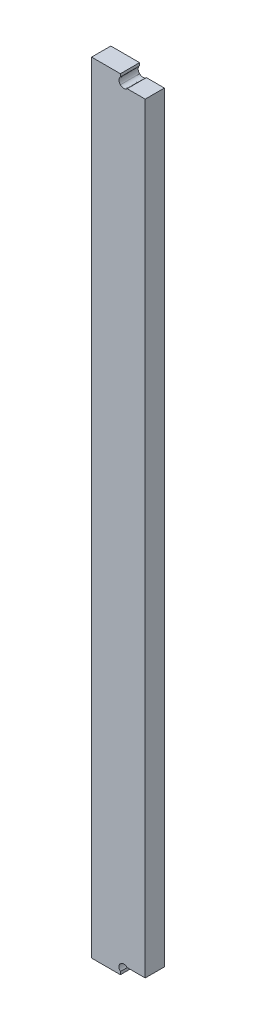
ISO-10303-21;
HEADER;
FILE_DESCRIPTION(('STEP AP214'),'2;1');
FILE_NAME('part.step','',(''),(''),'','','');
FILE_SCHEMA(('AUTOMOTIVE_DESIGN { 1 0 10303 214 1 1 1 1 }'));
ENDSEC;
DATA;
#1=APPLICATION_CONTEXT('core data for automotive mechanical design processes');
#2=APPLICATION_PROTOCOL_DEFINITION('international standard','automotive_design',2000,#1);
#3=PRODUCT_CONTEXT('',#1,'mechanical');
#4=PRODUCT('Part','Part','',(#3));
#5=PRODUCT_RELATED_PRODUCT_CATEGORY('part','',(#4));
#6=PRODUCT_DEFINITION_FORMATION('','',#4);
#7=PRODUCT_DEFINITION_CONTEXT('part definition',#1,'design');
#8=PRODUCT_DEFINITION('design','',#6,#7);
#9=PRODUCT_DEFINITION_SHAPE('','',#8);
#10=(LENGTH_UNIT() NAMED_UNIT(*) SI_UNIT(.MILLI.,.METRE.));
#11=(NAMED_UNIT(*) PLANE_ANGLE_UNIT() SI_UNIT($,.RADIAN.));
#12=(NAMED_UNIT(*) SI_UNIT($,.STERADIAN.) SOLID_ANGLE_UNIT());
#13=UNCERTAINTY_MEASURE_WITH_UNIT(LENGTH_MEASURE(1.E-05),#10,'distance_accuracy_value','');
#14=(GEOMETRIC_REPRESENTATION_CONTEXT(3) GLOBAL_UNCERTAINTY_ASSIGNED_CONTEXT((#13)) GLOBAL_UNIT_ASSIGNED_CONTEXT((#10,
#11,#12)) REPRESENTATION_CONTEXT('',''));
#15=CARTESIAN_POINT('',(0.,0.,0.));
#16=DIRECTION('',(0.,0.,1.));
#17=DIRECTION('',(1.,0.,0.));
#18=AXIS2_PLACEMENT_3D('',#15,#16,#17);
#19=CARTESIAN_POINT('',(2408.29831315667,61.4112591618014,6.));
#20=CARTESIAN_POINT('',(2407.71251773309,60.8254206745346,6.));
#21=CARTESIAN_POINT('',(2406.76276950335,60.8254206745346,6.));
#22=CARTESIAN_POINT('',(2406.17699561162,61.4112591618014,6.));
#23=B_SPLINE_CURVE_WITH_KNOTS('',3,(#19,#20,#21,#22),.UNSPECIFIED.,.F.,.F.,(4,4),(8.,9.),.UNSPECIFIED.);
#24=DIRECTION('',(0.,0.,-1.));
#25=VECTOR('',#24,1.);
#26=SURFACE_OF_LINEAR_EXTRUSION('',#23,#25);
#27=CARTESIAN_POINT('',(2408.29831315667,61.4112591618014,0.));
#28=CARTESIAN_POINT('',(2407.71251773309,60.8254206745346,0.));
#29=CARTESIAN_POINT('',(2406.76276950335,60.8254206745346,0.));
#30=CARTESIAN_POINT('',(2406.17699561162,61.4112591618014,0.));
#31=B_SPLINE_CURVE_WITH_KNOTS('',3,(#27,#28,#29,#30),.UNSPECIFIED.,.F.,.F.,(4,4),(8.,9.),.UNSPECIFIED.);
#32=CARTESIAN_POINT('',(2408.29831315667,61.4112591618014,0.));
#33=VERTEX_POINT('',#32);
#34=CARTESIAN_POINT('',(2406.17699561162,61.4112591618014,0.));
#35=VERTEX_POINT('',#34);
#36=EDGE_CURVE('E157',#33,#35,#31,.T.);
#37=ORIENTED_EDGE('',*,*,#36,.T.);
#38=DIRECTION('',(0.,0.,-1.));
#39=VECTOR('',#38,1.);
#40=CARTESIAN_POINT('',(2406.17699561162,61.4112591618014,6.));
#41=LINE('',#40,#39);
#42=CARTESIAN_POINT('',(2406.17699561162,61.4112591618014,6.));
#43=VERTEX_POINT('',#42);
#44=EDGE_CURVE('E11',#43,#35,#41,.T.);
#45=ORIENTED_EDGE('',*,*,#44,.F.);
#46=CARTESIAN_POINT('',(2408.29831315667,61.4112591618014,6.));
#47=VERTEX_POINT('',#46);
#48=EDGE_CURVE('E199',#47,#43,#23,.T.);
#49=ORIENTED_EDGE('',*,*,#48,.F.);
#50=DIRECTION('',(0.,0.,-1.));
#51=VECTOR('',#50,1.);
#52=CARTESIAN_POINT('',(2408.29831315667,61.4112591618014,6.));
#53=LINE('',#52,#51);
#54=EDGE_CURVE('E153',#47,#33,#53,.T.);
#55=ORIENTED_EDGE('',*,*,#54,.T.);
#56=EDGE_LOOP('',(#37,#45,#49,#55));
#57=FACE_BOUND('',#56,.T.);
#58=ADVANCED_FACE('F36',(#57),#26,.F.);
#59=CARTESIAN_POINT('',(2406.17699561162,61.4112591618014,6.));
#60=CARTESIAN_POINT('',(2405.59120018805,61.9969253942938,6.));
#61=CARTESIAN_POINT('',(2405.59120018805,62.9467382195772,6.));
#62=CARTESIAN_POINT('',(2406.17699561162,63.5324044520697,6.));
#63=B_SPLINE_CURVE_WITH_KNOTS('',3,(#59,#60,#61,#62),.UNSPECIFIED.,.F.,.F.,(4,4),(9.,10.),.UNSPECIFIED.);
#64=DIRECTION('',(0.,0.,-1.));
#65=VECTOR('',#64,1.);
#66=SURFACE_OF_LINEAR_EXTRUSION('',#63,#65);
#67=CARTESIAN_POINT('',(2406.17699561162,61.4112591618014,0.));
#68=CARTESIAN_POINT('',(2405.59120018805,61.9969253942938,0.));
#69=CARTESIAN_POINT('',(2405.59120018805,62.9467382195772,0.));
#70=CARTESIAN_POINT('',(2406.17699561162,63.5324044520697,0.));
#71=B_SPLINE_CURVE_WITH_KNOTS('',3,(#67,#68,#69,#70),.UNSPECIFIED.,.F.,.F.,(4,4),(9.,10.),.UNSPECIFIED.);
#72=CARTESIAN_POINT('',(2406.17699561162,63.5324044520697,0.));
#73=VERTEX_POINT('',#72);
#74=EDGE_CURVE('E162',#35,#73,#71,.T.);
#75=ORIENTED_EDGE('',*,*,#74,.T.);
#76=DIRECTION('',(0.,0.,-1.));
#77=VECTOR('',#76,1.);
#78=CARTESIAN_POINT('',(2406.17699561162,63.5324044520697,6.));
#79=LINE('',#78,#77);
#80=CARTESIAN_POINT('',(2406.17699561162,63.5324044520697,6.));
#81=VERTEX_POINT('',#80);
#82=EDGE_CURVE('E45',#81,#73,#79,.T.);
#83=ORIENTED_EDGE('',*,*,#82,.F.);
#84=EDGE_CURVE('E108',#43,#81,#63,.T.);
#85=ORIENTED_EDGE('',*,*,#84,.F.);
#86=ORIENTED_EDGE('',*,*,#44,.T.);
#87=EDGE_LOOP('',(#75,#83,#85,#86));
#88=FACE_BOUND('',#87,.T.);
#89=ADVANCED_FACE('F283',(#88),#66,.F.);
#90=CARTESIAN_POINT('',(2406.17699561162,0.,6.));
#91=DIRECTION('',(-1.,0.,0.));
#92=DIRECTION('',(0.,0.,1.));
#93=AXIS2_PLACEMENT_3D('',#90,#91,#92);
#94=PLANE('',#93);
#95=DIRECTION('',(0.,1.,0.));
#96=VECTOR('',#95,1.);
#97=CARTESIAN_POINT('',(2406.17699561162,0.,0.));
#98=LINE('',#97,#96);
#99=CARTESIAN_POINT('',(2406.17699561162,64.4112483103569,0.));
#100=VERTEX_POINT('',#99);
#101=EDGE_CURVE('E169',#73,#100,#98,.T.);
#102=ORIENTED_EDGE('',*,*,#101,.T.);
#103=DIRECTION('',(0.,0.,-1.));
#104=VECTOR('',#103,1.);
#105=CARTESIAN_POINT('',(2406.17699561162,64.4112483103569,6.));
#106=LINE('',#105,#104);
#107=CARTESIAN_POINT('',(2406.17699561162,64.4112483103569,6.));
#108=VERTEX_POINT('',#107);
#109=EDGE_CURVE('E218',#108,#100,#106,.T.);
#110=ORIENTED_EDGE('',*,*,#109,.F.);
#111=DIRECTION('',(0.,1.,0.));
#112=VECTOR('',#111,1.);
#113=CARTESIAN_POINT('',(2406.17699561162,0.,6.));
#114=LINE('',#113,#112);
#115=EDGE_CURVE('E226',#81,#108,#114,.T.);
#116=ORIENTED_EDGE('',*,*,#115,.F.);
#117=ORIENTED_EDGE('',*,*,#82,.T.);
#118=EDGE_LOOP('',(#102,#110,#116,#117));
#119=FACE_BOUND('',#118,.T.);
#120=ADVANCED_FACE('F224',(#119),#94,.F.);
#121=CARTESIAN_POINT('',(0.,64.4112483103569,6.));
#122=DIRECTION('',(0.,-1.,0.));
#123=DIRECTION('',(0.,0.,-1.));
#124=AXIS2_PLACEMENT_3D('',#121,#122,#123);
#125=PLANE('',#124);
#126=DIRECTION('',(-1.,0.,0.));
#127=VECTOR('',#126,1.);
#128=CARTESIAN_POINT('',(0.,64.4112483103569,0.));
#129=LINE('',#128,#127);
#130=CARTESIAN_POINT('',(2397.17698510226,64.4112483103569,0.));
#131=VERTEX_POINT('',#130);
#132=EDGE_CURVE('E174',#100,#131,#129,.T.);
#133=ORIENTED_EDGE('',*,*,#132,.T.);
#134=DIRECTION('',(0.,0.,-1.));
#135=VECTOR('',#134,1.);
#136=CARTESIAN_POINT('',(2397.17698510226,64.4112483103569,6.));
#137=LINE('',#136,#135);
#138=CARTESIAN_POINT('',(2397.17698510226,64.4112483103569,6.));
#139=VERTEX_POINT('',#138);
#140=EDGE_CURVE('E215',#139,#131,#137,.T.);
#141=ORIENTED_EDGE('',*,*,#140,.F.);
#142=DIRECTION('',(-1.,0.,0.));
#143=VECTOR('',#142,1.);
#144=CARTESIAN_POINT('',(0.,64.4112483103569,6.));
#145=LINE('',#144,#143);
#146=EDGE_CURVE('E244',#108,#139,#145,.T.);
#147=ORIENTED_EDGE('',*,*,#146,.F.);
#148=ORIENTED_EDGE('',*,*,#109,.T.);
#149=EDGE_LOOP('',(#133,#141,#147,#148));
#150=FACE_BOUND('',#149,.T.);
#151=ADVANCED_FACE('F235',(#150),#125,.F.);
#152=CARTESIAN_POINT('',(2397.17698510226,0.,6.));
#153=DIRECTION('',(1.,0.,0.));
#154=DIRECTION('',(0.,0.,-1.));
#155=AXIS2_PLACEMENT_3D('',#152,#153,#154);
#156=PLANE('',#155);
#157=DIRECTION('',(0.,-1.,0.));
#158=VECTOR('',#157,1.);
#159=CARTESIAN_POINT('',(2397.17698510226,0.,0.));
#160=LINE('',#159,#158);
#161=CARTESIAN_POINT('',(2397.17698510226,-179.588845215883,0.));
#162=VERTEX_POINT('',#161);
#163=EDGE_CURVE('E176',#131,#162,#160,.T.);
#164=ORIENTED_EDGE('',*,*,#163,.T.);
#165=DIRECTION('',(0.,0.,-1.));
#166=VECTOR('',#165,1.);
#167=CARTESIAN_POINT('',(2397.17698510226,-179.588845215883,6.));
#168=LINE('',#167,#166);
#169=CARTESIAN_POINT('',(2397.17698510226,-179.588845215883,6.));
#170=VERTEX_POINT('',#169);
#171=EDGE_CURVE('E212',#170,#162,#168,.T.);
#172=ORIENTED_EDGE('',*,*,#171,.F.);
#173=DIRECTION('',(0.,-1.,0.));
#174=VECTOR('',#173,1.);
#175=CARTESIAN_POINT('',(2397.17698510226,0.,6.));
#176=LINE('',#175,#174);
#177=EDGE_CURVE('E241',#139,#170,#176,.T.);
#178=ORIENTED_EDGE('',*,*,#177,.F.);
#179=ORIENTED_EDGE('',*,*,#140,.T.);
#180=EDGE_LOOP('',(#164,#172,#178,#179));
#181=FACE_BOUND('',#180,.T.);
#182=ADVANCED_FACE('F239',(#181),#156,.F.);
#183=CARTESIAN_POINT('',(0.,-179.588845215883,6.));
#184=DIRECTION('',(0.,1.,0.));
#185=DIRECTION('',(0.,0.,1.));
#186=AXIS2_PLACEMENT_3D('',#183,#184,#185);
#187=PLANE('',#186);
#188=DIRECTION('',(1.,0.,0.));
#189=VECTOR('',#188,1.);
#190=CARTESIAN_POINT('',(0.,-179.588845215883,0.));
#191=LINE('',#190,#189);
#192=CARTESIAN_POINT('',(2406.17699561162,-179.588845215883,0.));
#193=VERTEX_POINT('',#192);
#194=EDGE_CURVE('E178',#162,#193,#191,.T.);
#195=ORIENTED_EDGE('',*,*,#194,.T.);
#196=DIRECTION('',(0.,0.,-1.));
#197=VECTOR('',#196,1.);
#198=CARTESIAN_POINT('',(2406.17699561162,-179.588845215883,6.));
#199=LINE('',#198,#197);
#200=CARTESIAN_POINT('',(2406.17699561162,-179.588845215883,6.));
#201=VERTEX_POINT('',#200);
#202=EDGE_CURVE('E209',#201,#193,#199,.T.);
#203=ORIENTED_EDGE('',*,*,#202,.F.);
#204=DIRECTION('',(1.,0.,0.));
#205=VECTOR('',#204,1.);
#206=CARTESIAN_POINT('',(0.,-179.588845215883,6.));
#207=LINE('',#206,#205);
#208=EDGE_CURVE('E243',#170,#201,#207,.T.);
#209=ORIENTED_EDGE('',*,*,#208,.F.);
#210=ORIENTED_EDGE('',*,*,#171,.T.);
#211=EDGE_LOOP('',(#195,#203,#209,#210));
#212=FACE_BOUND('',#211,.T.);
#213=ADVANCED_FACE('F273',(#212),#187,.F.);
#214=CARTESIAN_POINT('',(2406.17699561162,0.,6.));
#215=DIRECTION('',(-1.,0.,0.));
#216=DIRECTION('',(0.,0.,1.));
#217=AXIS2_PLACEMENT_3D('',#214,#215,#216);
#218=PLANE('',#217);
#219=DIRECTION('',(0.,1.,0.));
#220=VECTOR('',#219,1.);
#221=CARTESIAN_POINT('',(2406.17699561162,0.,0.));
#222=LINE('',#221,#220);
#223=CARTESIAN_POINT('',(2406.17699561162,-178.71017361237,0.));
#224=VERTEX_POINT('',#223);
#225=EDGE_CURVE('E180',#193,#224,#222,.T.);
#226=ORIENTED_EDGE('',*,*,#225,.T.);
#227=DIRECTION('',(0.,0.,-1.));
#228=VECTOR('',#227,1.);
#229=CARTESIAN_POINT('',(2406.17699561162,-178.71017361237,6.));
#230=LINE('',#229,#228);
#231=CARTESIAN_POINT('',(2406.17699561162,-178.71017361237,6.));
#232=VERTEX_POINT('',#231);
#233=EDGE_CURVE('E206',#232,#224,#230,.T.);
#234=ORIENTED_EDGE('',*,*,#233,.F.);
#235=DIRECTION('',(0.,1.,0.));
#236=VECTOR('',#235,1.);
#237=CARTESIAN_POINT('',(2406.17699561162,0.,6.));
#238=LINE('',#237,#236);
#239=EDGE_CURVE('E246',#201,#232,#238,.T.);
#240=ORIENTED_EDGE('',*,*,#239,.F.);
#241=ORIENTED_EDGE('',*,*,#202,.T.);
#242=EDGE_LOOP('',(#226,#234,#240,#241));
#243=FACE_BOUND('',#242,.T.);
#244=ADVANCED_FACE('F268',(#243),#218,.F.);
#245=CARTESIAN_POINT('',(2406.17699561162,-178.71017361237,6.));
#246=CARTESIAN_POINT('',(2405.59120018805,-178.124335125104,6.));
#247=CARTESIAN_POINT('',(2405.59120018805,-177.174694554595,6.));
#248=CARTESIAN_POINT('',(2406.17699561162,-176.588856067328,6.));
#249=B_SPLINE_CURVE_WITH_KNOTS('',3,(#245,#246,#247,#248),.UNSPECIFIED.,.F.,.F.,(4,4),(3.,4.),.UNSPECIFIED.);
#250=DIRECTION('',(0.,0.,-1.));
#251=VECTOR('',#250,1.);
#252=SURFACE_OF_LINEAR_EXTRUSION('',#249,#251);
#253=CARTESIAN_POINT('',(2406.17699561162,-178.71017361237,0.));
#254=CARTESIAN_POINT('',(2405.59120018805,-178.124335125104,0.));
#255=CARTESIAN_POINT('',(2405.59120018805,-177.174694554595,0.));
#256=CARTESIAN_POINT('',(2406.17699561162,-176.588856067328,0.));
#257=B_SPLINE_CURVE_WITH_KNOTS('',3,(#253,#254,#255,#256),.UNSPECIFIED.,.F.,.F.,(4,4),(3.,4.),.UNSPECIFIED.);
#258=CARTESIAN_POINT('',(2406.17699561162,-176.588856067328,0.));
#259=VERTEX_POINT('',#258);
#260=EDGE_CURVE('E182',#224,#259,#257,.T.);
#261=ORIENTED_EDGE('',*,*,#260,.T.);
#262=DIRECTION('',(0.,0.,-1.));
#263=VECTOR('',#262,1.);
#264=CARTESIAN_POINT('',(2406.17699561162,-176.588856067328,6.));
#265=LINE('',#264,#263);
#266=CARTESIAN_POINT('',(2406.17699561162,-176.588856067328,6.));
#267=VERTEX_POINT('',#266);
#268=EDGE_CURVE('E203',#267,#259,#265,.T.);
#269=ORIENTED_EDGE('',*,*,#268,.F.);
#270=EDGE_CURVE('E252',#232,#267,#249,.T.);
#271=ORIENTED_EDGE('',*,*,#270,.F.);
#272=ORIENTED_EDGE('',*,*,#233,.T.);
#273=EDGE_LOOP('',(#261,#269,#271,#272));
#274=FACE_BOUND('',#273,.T.);
#275=ADVANCED_FACE('F263',(#274),#252,.F.);
#276=CARTESIAN_POINT('',(2406.17699561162,-176.588856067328,6.));
#277=CARTESIAN_POINT('',(2406.76276950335,-176.003017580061,6.));
#278=CARTESIAN_POINT('',(2407.71251773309,-176.003017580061,6.));
#279=CARTESIAN_POINT('',(2408.29831315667,-176.588856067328,6.));
#280=B_SPLINE_CURVE_WITH_KNOTS('',3,(#276,#277,#278,#279),.UNSPECIFIED.,.F.,.F.,(4,4),(4.,5.),.UNSPECIFIED.);
#281=DIRECTION('',(0.,0.,-1.));
#282=VECTOR('',#281,1.);
#283=SURFACE_OF_LINEAR_EXTRUSION('',#280,#282);
#284=CARTESIAN_POINT('',(2406.17699561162,-176.588856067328,0.));
#285=CARTESIAN_POINT('',(2406.76276950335,-176.003017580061,0.));
#286=CARTESIAN_POINT('',(2407.71251773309,-176.003017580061,0.));
#287=CARTESIAN_POINT('',(2408.29831315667,-176.588856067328,0.));
#288=B_SPLINE_CURVE_WITH_KNOTS('',3,(#284,#285,#286,#287),.UNSPECIFIED.,.F.,.F.,(4,4),(4.,5.),.UNSPECIFIED.);
#289=CARTESIAN_POINT('',(2408.29831315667,-176.588856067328,0.));
#290=VERTEX_POINT('',#289);
#291=EDGE_CURVE('E186',#259,#290,#288,.T.);
#292=ORIENTED_EDGE('',*,*,#291,.T.);
#293=DIRECTION('',(0.,0.,-1.));
#294=VECTOR('',#293,1.);
#295=CARTESIAN_POINT('',(2408.29831315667,-176.588856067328,6.));
#296=LINE('',#295,#294);
#297=CARTESIAN_POINT('',(2408.29831315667,-176.588856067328,6.));
#298=VERTEX_POINT('',#297);
#299=EDGE_CURVE('E148',#298,#290,#296,.T.);
#300=ORIENTED_EDGE('',*,*,#299,.F.);
#301=EDGE_CURVE('E139',#267,#298,#280,.T.);
#302=ORIENTED_EDGE('',*,*,#301,.F.);
#303=ORIENTED_EDGE('',*,*,#268,.T.);
#304=EDGE_LOOP('',(#292,#300,#302,#303));
#305=FACE_BOUND('',#304,.T.);
#306=ADVANCED_FACE('F267',(#305),#283,.F.);
#307=CARTESIAN_POINT('',(0.,-176.588856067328,6.));
#308=DIRECTION('',(0.,1.,0.));
#309=DIRECTION('',(0.,0.,1.));
#310=AXIS2_PLACEMENT_3D('',#307,#308,#309);
#311=PLANE('',#310);
#312=DIRECTION('',(1.,0.,0.));
#313=VECTOR('',#312,1.);
#314=CARTESIAN_POINT('',(0.,-176.588856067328,0.));
#315=LINE('',#314,#313);
#316=CARTESIAN_POINT('',(2413.93791293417,-176.588856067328,0.));
#317=VERTEX_POINT('',#316);
#318=EDGE_CURVE('E147',#290,#317,#315,.T.);
#319=ORIENTED_EDGE('',*,*,#318,.T.);
#320=DIRECTION('',(0.,0.,-1.));
#321=VECTOR('',#320,1.);
#322=CARTESIAN_POINT('',(2413.93791293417,-176.588856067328,6.));
#323=LINE('',#322,#321);
#324=CARTESIAN_POINT('',(2413.93791293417,-176.588856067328,6.));
#325=VERTEX_POINT('',#324);
#326=EDGE_CURVE('E144',#325,#317,#323,.T.);
#327=ORIENTED_EDGE('',*,*,#326,.F.);
#328=DIRECTION('',(1.,0.,0.));
#329=VECTOR('',#328,1.);
#330=CARTESIAN_POINT('',(0.,-176.588856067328,6.));
#331=LINE('',#330,#329);
#332=EDGE_CURVE('E133',#298,#325,#331,.T.);
#333=ORIENTED_EDGE('',*,*,#332,.F.);
#334=ORIENTED_EDGE('',*,*,#299,.T.);
#335=EDGE_LOOP('',(#319,#327,#333,#334));
#336=FACE_BOUND('',#335,.T.);
#337=ADVANCED_FACE('F145',(#336),#311,.F.);
#338=CARTESIAN_POINT('',(2413.93791293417,0.,6.));
#339=DIRECTION('',(-1.,0.,0.));
#340=DIRECTION('',(0.,0.,1.));
#341=AXIS2_PLACEMENT_3D('',#338,#339,#340);
#342=PLANE('',#341);
#343=DIRECTION('',(0.,1.,0.));
#344=VECTOR('',#343,1.);
#345=CARTESIAN_POINT('',(2413.93791293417,0.,0.));
#346=LINE('',#345,#344);
#347=CARTESIAN_POINT('',(2413.93791293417,61.4112591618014,0.));
#348=VERTEX_POINT('',#347);
#349=EDGE_CURVE('E94',#317,#348,#346,.T.);
#350=ORIENTED_EDGE('',*,*,#349,.T.);
#351=DIRECTION('',(0.,0.,-1.));
#352=VECTOR('',#351,1.);
#353=CARTESIAN_POINT('',(2413.93791293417,61.4112591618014,6.));
#354=LINE('',#353,#352);
#355=CARTESIAN_POINT('',(2413.93791293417,61.4112591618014,6.));
#356=VERTEX_POINT('',#355);
#357=EDGE_CURVE('E149',#356,#348,#354,.T.);
#358=ORIENTED_EDGE('',*,*,#357,.F.);
#359=DIRECTION('',(0.,1.,0.));
#360=VECTOR('',#359,1.);
#361=CARTESIAN_POINT('',(2413.93791293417,0.,6.));
#362=LINE('',#361,#360);
#363=EDGE_CURVE('E137',#325,#356,#362,.T.);
#364=ORIENTED_EDGE('',*,*,#363,.F.);
#365=ORIENTED_EDGE('',*,*,#326,.T.);
#366=EDGE_LOOP('',(#350,#358,#364,#365));
#367=FACE_BOUND('',#366,.T.);
#368=ADVANCED_FACE('F151',(#367),#342,.F.);
#369=CARTESIAN_POINT('',(0.,61.4112591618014,6.));
#370=DIRECTION('',(0.,-1.,0.));
#371=DIRECTION('',(0.,0.,-1.));
#372=AXIS2_PLACEMENT_3D('',#369,#370,#371);
#373=PLANE('',#372);
#374=DIRECTION('',(-1.,0.,0.));
#375=VECTOR('',#374,1.);
#376=CARTESIAN_POINT('',(0.,61.4112591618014,0.));
#377=LINE('',#376,#375);
#378=EDGE_CURVE('E100',#348,#33,#377,.T.);
#379=ORIENTED_EDGE('',*,*,#378,.T.);
#380=ORIENTED_EDGE('',*,*,#54,.F.);
#381=DIRECTION('',(-1.,0.,0.));
#382=VECTOR('',#381,1.);
#383=CARTESIAN_POINT('',(0.,61.4112591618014,6.));
#384=LINE('',#383,#382);
#385=EDGE_CURVE('E53',#356,#47,#384,.T.);
#386=ORIENTED_EDGE('',*,*,#385,.F.);
#387=ORIENTED_EDGE('',*,*,#357,.T.);
#388=EDGE_LOOP('',(#379,#380,#386,#387));
#389=FACE_BOUND('',#388,.T.);
#390=ADVANCED_FACE('F369',(#389),#373,.F.);
#391=CARTESIAN_POINT('',(0.,0.,6.));
#392=DIRECTION('',(0.,0.,1.));
#393=DIRECTION('',(1.,0.,0.));
#394=AXIS2_PLACEMENT_3D('',#391,#392,#393);
#395=PLANE('',#394);
#396=ORIENTED_EDGE('',*,*,#48,.T.);
#397=ORIENTED_EDGE('',*,*,#84,.T.);
#398=ORIENTED_EDGE('',*,*,#115,.T.);
#399=ORIENTED_EDGE('',*,*,#146,.T.);
#400=ORIENTED_EDGE('',*,*,#177,.T.);
#401=ORIENTED_EDGE('',*,*,#208,.T.);
#402=ORIENTED_EDGE('',*,*,#239,.T.);
#403=ORIENTED_EDGE('',*,*,#270,.T.);
#404=ORIENTED_EDGE('',*,*,#301,.T.);
#405=ORIENTED_EDGE('',*,*,#332,.T.);
#406=ORIENTED_EDGE('',*,*,#363,.T.);
#407=ORIENTED_EDGE('',*,*,#385,.T.);
#408=EDGE_LOOP('',(#396,#397,#398,#399,#400,#401,#402,#403,#404,#405,#406,#407));
#409=FACE_BOUND('',#408,.T.);
#410=ADVANCED_FACE('F135',(#409),#395,.T.);
#411=CARTESIAN_POINT('',(0.,0.,0.));
#412=DIRECTION('',(0.,0.,1.));
#413=DIRECTION('',(1.,0.,0.));
#414=AXIS2_PLACEMENT_3D('',#411,#412,#413);
#415=PLANE('',#414);
#416=ORIENTED_EDGE('',*,*,#36,.F.);
#417=ORIENTED_EDGE('',*,*,#378,.F.);
#418=ORIENTED_EDGE('',*,*,#349,.F.);
#419=ORIENTED_EDGE('',*,*,#318,.F.);
#420=ORIENTED_EDGE('',*,*,#291,.F.);
#421=ORIENTED_EDGE('',*,*,#260,.F.);
#422=ORIENTED_EDGE('',*,*,#225,.F.);
#423=ORIENTED_EDGE('',*,*,#194,.F.);
#424=ORIENTED_EDGE('',*,*,#163,.F.);
#425=ORIENTED_EDGE('',*,*,#132,.F.);
#426=ORIENTED_EDGE('',*,*,#101,.F.);
#427=ORIENTED_EDGE('',*,*,#74,.F.);
#428=EDGE_LOOP('',(#416,#417,#418,#419,#420,#421,#422,#423,#424,#425,#426,#427));
#429=FACE_BOUND('',#428,.T.);
#430=ADVANCED_FACE('F230',(#429),#415,.F.);
#431=CLOSED_SHELL('',(#58,#89,#120,#151,#182,#213,#244,#275,#306,#337,#368,#390,#410,#430));
#432=MANIFOLD_SOLID_BREP('B2',#431);
#433=ADVANCED_BREP_SHAPE_REPRESENTATION('',(#18,#432),#14);
#434=SHAPE_DEFINITION_REPRESENTATION(#9,#433);
ENDSEC;
END-ISO-10303-21;
